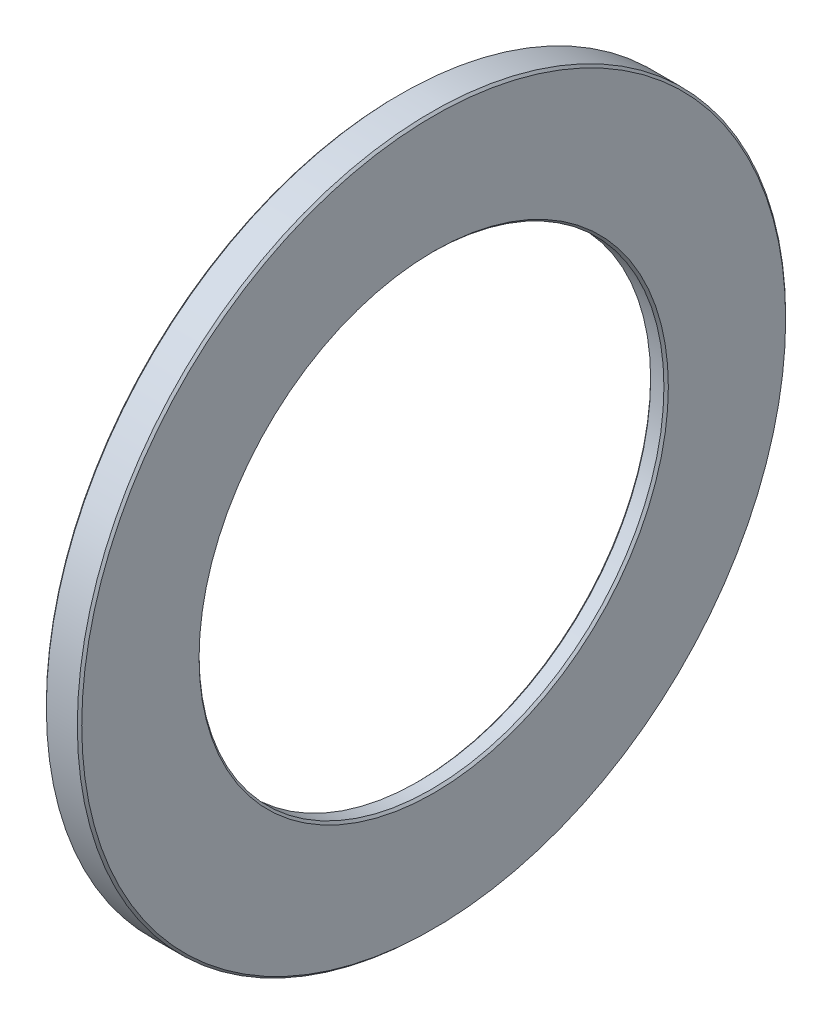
from build123d import *

# Parameters (mm, degrees)
CHANFREIN1_SIZE = 0.5


with BuildPart() as part:
    # Esquisse1 → R_volution1 (revolve)
    with BuildSketch(Plane.XY, mode=Mode.PRIVATE) as r_volution1_sk:
        Polygon((0, 80), (0, 72.5), (4, 72.5), (4, 52.5), (8, 52.5), (8, 80), align=None)
    revolve(r_volution1_sk.sketch.rotate(Axis((0, 0, 0), (1, 0, 0)), 90), axis=Axis((0, 0, 0), (1, 0, 0)))

    # Chanfrein1
    chanfrein1_edges = [part.edges().sort_by_distance(p)[0] for p in [
        (0, 0, -80),
        (0, 0, -72.5),
        (4, 0, -52.5),
        (8, 0, -52.5),
        (8, 0, -80),
    ]]
    chamfer(chanfrein1_edges, length=CHANFREIN1_SIZE)


solid = part.part
